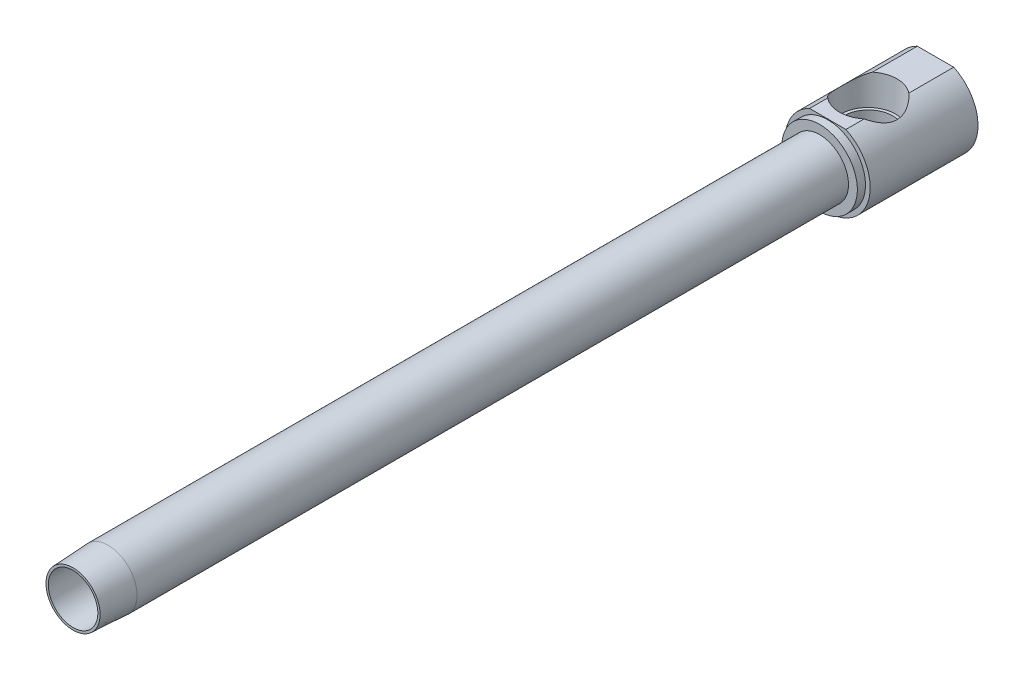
ISO-10303-21;
HEADER;
FILE_DESCRIPTION(('STEP AP214'),'2;1');
FILE_NAME('part.step','',(''),(''),'','','');
FILE_SCHEMA(('AUTOMOTIVE_DESIGN { 1 0 10303 214 1 1 1 1 }'));
ENDSEC;
DATA;
#1=APPLICATION_CONTEXT('core data for automotive mechanical design processes');
#2=APPLICATION_PROTOCOL_DEFINITION('international standard','automotive_design',2000,#1);
#3=PRODUCT_CONTEXT('',#1,'mechanical');
#4=PRODUCT('Part','Part','',(#3));
#5=PRODUCT_RELATED_PRODUCT_CATEGORY('part','',(#4));
#6=PRODUCT_DEFINITION_FORMATION('','',#4);
#7=PRODUCT_DEFINITION_CONTEXT('part definition',#1,'design');
#8=PRODUCT_DEFINITION('design','',#6,#7);
#9=PRODUCT_DEFINITION_SHAPE('','',#8);
#10=(LENGTH_UNIT() NAMED_UNIT(*) SI_UNIT(.MILLI.,.METRE.));
#11=(NAMED_UNIT(*) PLANE_ANGLE_UNIT() SI_UNIT($,.RADIAN.));
#12=(NAMED_UNIT(*) SI_UNIT($,.STERADIAN.) SOLID_ANGLE_UNIT());
#13=UNCERTAINTY_MEASURE_WITH_UNIT(LENGTH_MEASURE(1.E-05),#10,'distance_accuracy_value','');
#14=(GEOMETRIC_REPRESENTATION_CONTEXT(3) GLOBAL_UNCERTAINTY_ASSIGNED_CONTEXT((#13)) GLOBAL_UNIT_ASSIGNED_CONTEXT((#10,
#11,#12)) REPRESENTATION_CONTEXT('',''));
#15=CARTESIAN_POINT('',(0.,0.,0.));
#16=DIRECTION('',(0.,0.,1.));
#17=DIRECTION('',(1.,0.,0.));
#18=AXIS2_PLACEMENT_3D('',#15,#16,#17);
#19=CARTESIAN_POINT('',(-7.29488,0.,0.));
#20=DIRECTION('',(0.,0.,1.));
#21=DIRECTION('',(1.,0.,0.));
#22=AXIS2_PLACEMENT_3D('',#19,#20,#21);
#23=PLANE('',#22);
#24=CARTESIAN_POINT('',(0.,0.,0.));
#25=DIRECTION('',(0.,0.,-1.));
#26=DIRECTION('',(-1.,0.,0.));
#27=AXIS2_PLACEMENT_3D('',#24,#25,#26);
#28=CIRCLE('',#27,7.29488);
#29=CARTESIAN_POINT('',(-7.29488,0.,0.));
#30=VERTEX_POINT('',#29);
#31=EDGE_CURVE('E18',#30,#30,#28,.T.);
#32=ORIENTED_EDGE('',*,*,#31,.T.);
#33=EDGE_LOOP('',(#32));
#34=FACE_BOUND('',#33,.T.);
#35=CARTESIAN_POINT('',(0.,0.,0.));
#36=DIRECTION('',(0.,0.,-1.));
#37=DIRECTION('',(-1.,0.,0.));
#38=AXIS2_PLACEMENT_3D('',#35,#36,#37);
#39=CIRCLE('',#38,7.96721885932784);
#40=CARTESIAN_POINT('',(-7.96721885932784,0.,0.));
#41=VERTEX_POINT('',#40);
#42=EDGE_CURVE('E318',#41,#41,#39,.T.);
#43=ORIENTED_EDGE('',*,*,#42,.F.);
#44=EDGE_LOOP('',(#43));
#45=FACE_BOUND('',#44,.T.);
#46=ADVANCED_FACE('F15',(#34,#45),#23,.T.);
#47=CARTESIAN_POINT('',(0.,0.,-284.747166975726));
#48=DIRECTION('',(0.,0.,-1.));
#49=DIRECTION('',(-1.,0.,0.));
#50=AXIS2_PLACEMENT_3D('',#47,#48,#49);
#51=CYLINDRICAL_SURFACE('',#50,8.509);
#52=CARTESIAN_POINT('',(0.,0.,-10.3378));
#53=DIRECTION('',(0.,0.,-1.));
#54=DIRECTION('',(-1.,0.,0.));
#55=AXIS2_PLACEMENT_3D('',#52,#53,#54);
#56=CIRCLE('',#55,8.509);
#57=CARTESIAN_POINT('',(-8.509,0.,-10.3378));
#58=VERTEX_POINT('',#57);
#59=EDGE_CURVE('E320',#58,#58,#56,.T.);
#60=ORIENTED_EDGE('',*,*,#59,.T.);
#61=EDGE_LOOP('',(#60));
#62=FACE_BOUND('',#61,.T.);
#63=CARTESIAN_POINT('',(0.,0.,-219.8624));
#64=DIRECTION('',(0.,0.,-1.));
#65=DIRECTION('',(-1.,0.,0.));
#66=AXIS2_PLACEMENT_3D('',#63,#64,#65);
#67=CIRCLE('',#66,8.509);
#68=CARTESIAN_POINT('',(-8.509,0.,-219.8624));
#69=VERTEX_POINT('',#68);
#70=EDGE_CURVE('E152',#69,#69,#67,.T.);
#71=ORIENTED_EDGE('',*,*,#70,.F.);
#72=EDGE_LOOP('',(#71));
#73=FACE_BOUND('',#72,.T.);
#74=ADVANCED_FACE('F226',(#62,#73),#51,.T.);
#75=CARTESIAN_POINT('',(-5.3594,11.3032925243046,-209.55));
#76=DIRECTION('',(0.,-1.,0.));
#77=DIRECTION('',(0.,0.,-1.));
#78=AXIS2_PLACEMENT_3D('',#75,#76,#77);
#79=PLANE('',#78);
#80=DIRECTION('',(0.,0.,-1.));
#81=VECTOR('',#80,1.);
#82=CARTESIAN_POINT('',(5.3594,11.3032925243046,-209.55));
#83=LINE('',#82,#81);
#84=CARTESIAN_POINT('',(5.3594,11.3032925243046,-222.25));
#85=VERTEX_POINT('',#84);
#86=CARTESIAN_POINT('',(5.3594,11.3032925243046,-227.60323946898));
#87=VERTEX_POINT('',#86);
#88=EDGE_CURVE('E136',#85,#87,#83,.T.);
#89=ORIENTED_EDGE('',*,*,#88,.T.);
#90=CARTESIAN_POINT('',(0.,11.3032925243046,-234.188));
#91=DIRECTION('',(0.,-1.,0.));
#92=DIRECTION('',(0.,0.,-1.));
#93=AXIS2_PLACEMENT_3D('',#90,#91,#92);
#94=CIRCLE('',#93,8.49012600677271);
#95=CARTESIAN_POINT('',(-5.3594,11.3032925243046,-227.60323946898));
#96=VERTEX_POINT('',#95);
#97=EDGE_CURVE('E122',#87,#96,#94,.T.);
#98=ORIENTED_EDGE('',*,*,#97,.T.);
#99=DIRECTION('',(0.,0.,-1.));
#100=VECTOR('',#99,1.);
#101=CARTESIAN_POINT('',(-5.3594,11.3032925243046,-209.55));
#102=LINE('',#101,#100);
#103=CARTESIAN_POINT('',(-5.3594,11.3032925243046,-222.25));
#104=VERTEX_POINT('',#103);
#105=EDGE_CURVE('E147',#104,#96,#102,.T.);
#106=ORIENTED_EDGE('',*,*,#105,.F.);
#107=DIRECTION('',(1.,0.,0.));
#108=VECTOR('',#107,1.);
#109=CARTESIAN_POINT('',(-11.1125,11.3032925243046,-222.25));
#110=LINE('',#109,#108);
#111=EDGE_CURVE('E144',#104,#85,#110,.T.);
#112=ORIENTED_EDGE('',*,*,#111,.T.);
#113=EDGE_LOOP('',(#89,#98,#106,#112));
#114=FACE_BOUND('',#113,.T.);
#115=ADVANCED_FACE('F142',(#114),#79,.F.);
#116=CARTESIAN_POINT('',(0.,0.,-284.747166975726));
#117=DIRECTION('',(0.,0.,-1.));
#118=DIRECTION('',(-1.,0.,0.));
#119=AXIS2_PLACEMENT_3D('',#116,#117,#118);
#120=CYLINDRICAL_SURFACE('',#119,7.29488);
#121=ORIENTED_EDGE('',*,*,#31,.F.);
#122=EDGE_LOOP('',(#121));
#123=FACE_BOUND('',#122,.T.);
#124=CARTESIAN_POINT('',(0.,0.,-219.71));
#125=DIRECTION('',(0.,0.,-1.));
#126=DIRECTION('',(-1.,0.,0.));
#127=AXIS2_PLACEMENT_3D('',#124,#125,#126);
#128=CIRCLE('',#127,7.29488);
#129=CARTESIAN_POINT('',(-2.83926860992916,-6.71965981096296,-219.71));
#130=VERTEX_POINT('',#129);
#131=CARTESIAN_POINT('',(2.83926860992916,-6.71965981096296,-219.71));
#132=VERTEX_POINT('',#131);
#133=EDGE_CURVE('E166',#130,#132,#128,.T.);
#134=ORIENTED_EDGE('',*,*,#133,.T.);
#135=CARTESIAN_POINT('',(2.83926860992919,-6.71965981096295,-219.71));
#136=CARTESIAN_POINT('',(2.70908587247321,-6.7747056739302,-219.652021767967));
#137=CARTESIAN_POINT('',(2.57545350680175,-6.82667201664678,-219.598915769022));
#138=CARTESIAN_POINT('',(2.30236644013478,-6.92352687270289,-219.502164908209));
#139=CARTESIAN_POINT('',(2.16291320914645,-6.96841715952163,-219.458517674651));
#140=CARTESIAN_POINT('',(1.879420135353,-7.05016472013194,-219.380434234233));
#141=CARTESIAN_POINT('',(1.73538792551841,-7.08703463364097,-219.345983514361));
#142=CARTESIAN_POINT('',(1.44358277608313,-7.15218030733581,-219.285918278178));
#143=CARTESIAN_POINT('',(1.29580969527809,-7.18045574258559,-219.26030409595));
#144=CARTESIAN_POINT('',(0.997667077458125,-7.22791200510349,-219.217692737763));
#145=CARTESIAN_POINT('',(0.847298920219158,-7.2470975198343,-219.200691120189));
#146=CARTESIAN_POINT('',(0.544945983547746,-7.27608226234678,-219.175120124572));
#147=CARTESIAN_POINT('',(0.392961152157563,-7.28588118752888,-219.16655101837));
#148=CARTESIAN_POINT('',(0.0883390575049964,-7.29593786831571,-219.157757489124));
#149=CARTESIAN_POINT('',(-0.0642985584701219,-7.29618956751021,-219.157538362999));
#150=CARTESIAN_POINT('',(-0.369068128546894,-7.28713276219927,-219.165455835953));
#151=CARTESIAN_POINT('',(-0.521200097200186,-7.27782453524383,-219.173592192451));
#152=CARTESIAN_POINT('',(-0.825795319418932,-7.24962203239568,-219.198456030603));
#153=CARTESIAN_POINT('',(-0.978239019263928,-7.23060958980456,-219.215289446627));
#154=CARTESIAN_POINT('',(-1.28042184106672,-7.18325692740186,-219.257772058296));
#155=CARTESIAN_POINT('',(-1.43016107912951,-7.15491710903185,-219.283420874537));
#156=CARTESIAN_POINT('',(-1.72558403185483,-7.08946317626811,-219.343720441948));
#157=CARTESIAN_POINT('',(-1.87127414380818,-7.05236389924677,-219.378355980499));
#158=CARTESIAN_POINT('',(-2.15770494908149,-6.97006186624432,-219.456925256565));
#159=CARTESIAN_POINT('',(-2.29844851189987,-6.92486390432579,-219.500853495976));
#160=CARTESIAN_POINT('',(-2.50498218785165,-6.85169148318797,-219.573911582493));
#161=CARTESIAN_POINT('',(-2.5730332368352,-6.82641747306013,-219.599445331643));
#162=CARTESIAN_POINT('',(-2.70743134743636,-6.77423657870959,-219.652910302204));
#163=CARTESIAN_POINT('',(-2.77378053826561,-6.74733189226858,-219.680838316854));
#164=CARTESIAN_POINT('',(-2.83926860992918,-6.7196598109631,-219.71));
#165=B_SPLINE_CURVE_WITH_KNOTS('',3,(#135,#136,#137,#138,#139,#140,#141,#142,#143,#144,#145,
#146,#147,#148,#149,#150,#151,#152,#153,#154,#155,#156,#157,#158,#159,#160,#161,#162,#163,#164),
.UNSPECIFIED.,.F.,.F.,(4,2,2,2,2,2,2,2,2,2,2,2,2,2,4),(0.,0.458141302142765,0.91616759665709,
1.37346674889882,1.8307831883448,2.28786354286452,2.74495863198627,3.202343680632,
3.65971545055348,4.12279436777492,4.58585335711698,5.04813354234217,5.51014097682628,
5.74093493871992,5.97142447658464),.UNSPECIFIED.);
#166=EDGE_CURVE('E228',#132,#130,#165,.T.);
#167=ORIENTED_EDGE('',*,*,#166,.T.);
#168=EDGE_LOOP('',(#134,#167));
#169=FACE_BOUND('',#168,.T.);
#170=ADVANCED_FACE('F221',(#123,#169),#120,.F.);
#171=CARTESIAN_POINT('',(-7.29488,0.,-219.71));
#172=DIRECTION('',(0.,0.,1.));
#173=DIRECTION('',(1.,0.,0.));
#174=AXIS2_PLACEMENT_3D('',#171,#172,#173);
#175=PLANE('',#174);
#176=ORIENTED_EDGE('',*,*,#133,.F.);
#177=CARTESIAN_POINT('',(0.,-0.996470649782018,-219.71));
#178=DIRECTION('',(0.,0.,1.));
#179=DIRECTION('',(0.,-1.,0.));
#180=AXIS2_PLACEMENT_3D('',#177,#178,#179);
#181=ELLIPSE('',#180,6.41876281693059,6.27107494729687);
#182=EDGE_CURVE('E170',#130,#132,#181,.F.);
#183=ORIENTED_EDGE('',*,*,#182,.T.);
#184=EDGE_LOOP('',(#176,#183));
#185=FACE_BOUND('',#184,.T.);
#186=ADVANCED_FACE('F217',(#185),#175,.T.);
#187=CARTESIAN_POINT('',(-12.5095,0.,-254.));
#188=DIRECTION('',(0.,0.,-1.));
#189=DIRECTION('',(-1.,0.,0.));
#190=AXIS2_PLACEMENT_3D('',#187,#188,#189);
#191=PLANE('',#190);
#192=DIRECTION('',(1.,0.,0.));
#193=VECTOR('',#192,1.);
#194=CARTESIAN_POINT('',(-3.66617420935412,6.35,-254.));
#195=LINE('',#194,#193);
#196=CARTESIAN_POINT('',(-3.66617420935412,6.35,-254.));
#197=VERTEX_POINT('',#196);
#198=CARTESIAN_POINT('',(3.66617420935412,6.35,-254.));
#199=VERTEX_POINT('',#198);
#200=EDGE_CURVE('E235',#197,#199,#195,.T.);
#201=ORIENTED_EDGE('',*,*,#200,.F.);
#202=DIRECTION('',(0.5,0.866025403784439,0.));
#203=VECTOR('',#202,1.);
#204=CARTESIAN_POINT('',(-7.33234841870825,0.,-254.));
#205=LINE('',#204,#203);
#206=CARTESIAN_POINT('',(-7.33234841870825,0.,-254.));
#207=VERTEX_POINT('',#206);
#208=EDGE_CURVE('E242',#207,#197,#205,.T.);
#209=ORIENTED_EDGE('',*,*,#208,.F.);
#210=DIRECTION('',(-0.5,0.866025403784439,0.));
#211=VECTOR('',#210,1.);
#212=CARTESIAN_POINT('',(-3.66617420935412,-6.35,-254.));
#213=LINE('',#212,#211);
#214=CARTESIAN_POINT('',(-3.66617420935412,-6.35,-254.));
#215=VERTEX_POINT('',#214);
#216=EDGE_CURVE('E268',#215,#207,#213,.T.);
#217=ORIENTED_EDGE('',*,*,#216,.F.);
#218=DIRECTION('',(-1.,0.,0.));
#219=VECTOR('',#218,1.);
#220=CARTESIAN_POINT('',(3.66617420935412,-6.35,-254.));
#221=LINE('',#220,#219);
#222=CARTESIAN_POINT('',(3.66617420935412,-6.35,-254.));
#223=VERTEX_POINT('',#222);
#224=EDGE_CURVE('E265',#223,#215,#221,.T.);
#225=ORIENTED_EDGE('',*,*,#224,.F.);
#226=DIRECTION('',(-0.5,-0.866025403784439,0.));
#227=VECTOR('',#226,1.);
#228=CARTESIAN_POINT('',(7.33234841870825,0.,-254.));
#229=LINE('',#228,#227);
#230=CARTESIAN_POINT('',(7.33234841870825,0.,-254.));
#231=VERTEX_POINT('',#230);
#232=EDGE_CURVE('E262',#231,#223,#229,.T.);
#233=ORIENTED_EDGE('',*,*,#232,.F.);
#234=DIRECTION('',(0.5,-0.866025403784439,0.));
#235=VECTOR('',#234,1.);
#236=CARTESIAN_POINT('',(3.66617420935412,6.35,-254.));
#237=LINE('',#236,#235);
#238=EDGE_CURVE('E259',#199,#231,#237,.T.);
#239=ORIENTED_EDGE('',*,*,#238,.F.);
#240=EDGE_LOOP('',(#201,#209,#217,#225,#233,#239));
#241=FACE_BOUND('',#240,.T.);
#242=DIRECTION('',(-1.,0.,0.));
#243=VECTOR('',#242,1.);
#244=CARTESIAN_POINT('',(-5.3594,11.3032925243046,-254.));
#245=LINE('',#244,#243);
#246=CARTESIAN_POINT('',(5.3594,11.3032925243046,-254.));
#247=VERTEX_POINT('',#246);
#248=CARTESIAN_POINT('',(-5.3594,11.3032925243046,-254.));
#249=VERTEX_POINT('',#248);
#250=EDGE_CURVE('E149',#247,#249,#245,.T.);
#251=ORIENTED_EDGE('',*,*,#250,.F.);
#252=CARTESIAN_POINT('',(0.,0.,-254.));
#253=DIRECTION('',(0.,0.,-1.));
#254=DIRECTION('',(-1.,0.,0.));
#255=AXIS2_PLACEMENT_3D('',#252,#253,#254);
#256=CIRCLE('',#255,12.5095);
#257=EDGE_CURVE('E163',#247,#249,#256,.T.);
#258=ORIENTED_EDGE('',*,*,#257,.T.);
#259=EDGE_LOOP('',(#251,#258));
#260=FACE_BOUND('',#259,.T.);
#261=ADVANCED_FACE('F212',(#241,#260),#191,.T.);
#262=CARTESIAN_POINT('',(0.,0.,-284.747166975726));
#263=DIRECTION('',(0.,0.,-1.));
#264=DIRECTION('',(-1.,0.,0.));
#265=AXIS2_PLACEMENT_3D('',#262,#263,#264);
#266=CYLINDRICAL_SURFACE('',#265,12.5095);
#267=CARTESIAN_POINT('',(5.3589781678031,11.3034925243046,-227.602882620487));
#268=CARTESIAN_POINT('',(5.54921369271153,11.2133234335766,-227.763840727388));
#269=CARTESIAN_POINT('',(5.73165431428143,11.1209258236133,-227.932665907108));
#270=CARTESIAN_POINT('',(6.08048620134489,10.9340894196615,-228.285220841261));
#271=CARTESIAN_POINT('',(6.24687354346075,10.8396501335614,-228.46895421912));
#272=CARTESIAN_POINT('',(6.56420314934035,10.650502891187,-228.851812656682));
#273=CARTESIAN_POINT('',(6.71502345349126,10.5557980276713,-229.051040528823));
#274=CARTESIAN_POINT('',(6.99914257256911,10.3695935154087,-229.462863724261));
#275=CARTESIAN_POINT('',(7.13244448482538,10.2780933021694,-229.675456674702));
#276=CARTESIAN_POINT('',(7.46650834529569,10.0401700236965,-230.264674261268));
#277=CARTESIAN_POINT('',(7.6505480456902,9.89929381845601,-230.653481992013));
#278=CARTESIAN_POINT('',(7.88323238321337,9.71350267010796,-231.259963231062));
#279=CARTESIAN_POINT('',(7.95350713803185,9.65587918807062,-231.465745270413));
#280=CARTESIAN_POINT('',(8.07900681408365,9.5511210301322,-231.884515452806));
#281=CARTESIAN_POINT('',(8.1342346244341,9.50398434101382,-232.097502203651));
#282=CARTESIAN_POINT('',(8.22106638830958,9.42891275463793,-232.494107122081));
#283=CARTESIAN_POINT('',(8.25505388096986,9.39910020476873,-232.676852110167));
#284=CARTESIAN_POINT('',(8.3114428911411,9.34927427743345,-233.045430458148));
#285=CARTESIAN_POINT('',(8.3338466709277,9.32925898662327,-233.231263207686));
#286=CARTESIAN_POINT('',(8.36672861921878,9.29978140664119,-233.604727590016));
#287=CARTESIAN_POINT('',(8.37721265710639,9.29031392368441,-233.79235829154));
#288=CARTESIAN_POINT('',(8.3861052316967,9.28228778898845,-234.168146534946));
#289=CARTESIAN_POINT('',(8.38451351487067,9.28372936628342,-234.356304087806));
#290=CARTESIAN_POINT('',(8.36928475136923,9.29746017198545,-234.731613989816));
#291=CARTESIAN_POINT('',(8.35565497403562,9.30974285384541,-234.91876687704));
#292=CARTESIAN_POINT('',(8.3165791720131,9.3446659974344,-235.290843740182));
#293=CARTESIAN_POINT('',(8.2911332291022,9.36730638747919,-235.475767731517));
#294=CARTESIAN_POINT('',(8.22876601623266,9.42213985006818,-235.842394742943));
#295=CARTESIAN_POINT('',(8.19183425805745,9.45434165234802,-236.024094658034));
#296=CARTESIAN_POINT('',(8.10694730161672,9.52723048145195,-236.383247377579));
#297=CARTESIAN_POINT('',(8.0589858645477,9.56792230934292,-236.56069771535));
#298=CARTESIAN_POINT('',(7.93720028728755,9.66935365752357,-236.960957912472));
#299=CARTESIAN_POINT('',(7.85990590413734,9.73249157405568,-237.182109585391));
#300=CARTESIAN_POINT('',(7.68886075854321,9.86817719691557,-237.614976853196));
#301=CARTESIAN_POINT('',(7.5951043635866,9.94072812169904,-237.826689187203));
#302=CARTESIAN_POINT('',(7.39186656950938,10.092770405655,-238.240230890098));
#303=CARTESIAN_POINT('',(7.28236248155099,10.172271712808,-238.442045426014));
#304=CARTESIAN_POINT('',(7.04849385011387,10.3357003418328,-238.834850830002));
#305=CARTESIAN_POINT('',(6.92413202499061,10.4196268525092,-239.0258436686));
#306=CARTESIAN_POINT('',(6.58695562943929,10.6376413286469,-239.501021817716));
#307=CARTESIAN_POINT('',(6.36373226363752,10.7733928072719,-239.777203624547));
#308=CARTESIAN_POINT('',(6.00459360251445,10.9750283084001,-240.168460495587));
#309=CARTESIAN_POINT('',(5.88113847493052,11.0417585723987,-240.294781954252));
#310=CARTESIAN_POINT('',(5.62611191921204,11.1738564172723,-240.539769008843));
#311=CARTESIAN_POINT('',(5.49453878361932,11.2392237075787,-240.658432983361));
#312=CARTESIAN_POINT('',(5.3589781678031,11.3034925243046,-240.773117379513));
#313=B_SPLINE_CURVE_WITH_KNOTS('',3,(#267,#268,#269,#270,#271,#272,#273,#274,#275,#276,#277,
#278,#279,#280,#281,#282,#283,#284,#285,#286,#287,#288,#289,#290,#291,#292,#293,#294,#295,#296,
#297,#298,#299,#300,#301,#302,#303,#304,#305,#306,#307,#308,#309,#310,#311,#312),.UNSPECIFIED.,
.F.,.F.,(4,2,2,2,2,2,2,2,2,2,2,2,2,2,2,2,2,2,2,2,2,2,4),(0.,0.794684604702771,1.58956293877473,
2.39025916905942,3.19081364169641,4.54240556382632,5.21661127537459,5.89068744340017,
6.45486541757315,7.01893316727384,7.58272304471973,8.14652475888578,8.70998624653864,
9.27344383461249,9.83741745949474,10.4017108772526,11.1285534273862,11.855645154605,
12.5837951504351,13.3118121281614,14.4492964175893,15.0154674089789,15.5817578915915),.UNSPECIFIED.);
#314=CARTESIAN_POINT('',(5.3594,11.3032925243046,-240.77276053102));
#315=VERTEX_POINT('',#314);
#316=EDGE_CURVE('E30',#87,#315,#313,.T.);
#317=ORIENTED_EDGE('',*,*,#316,.F.);
#318=ORIENTED_EDGE('',*,*,#88,.F.);
#319=CARTESIAN_POINT('',(0.,0.,-222.25));
#320=DIRECTION('',(0.,0.,-1.));
#321=DIRECTION('',(-1.,0.,0.));
#322=AXIS2_PLACEMENT_3D('',#319,#320,#321);
#323=CIRCLE('',#322,12.5095);
#324=EDGE_CURVE('E161',#85,#104,#323,.T.);
#325=ORIENTED_EDGE('',*,*,#324,.T.);
#326=ORIENTED_EDGE('',*,*,#105,.T.);
#327=CARTESIAN_POINT('',(-5.3589781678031,11.3034925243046,-240.773117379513));
#328=CARTESIAN_POINT('',(-5.54921369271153,11.2133234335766,-240.612159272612));
#329=CARTESIAN_POINT('',(-5.73165431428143,11.1209258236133,-240.443334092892));
#330=CARTESIAN_POINT('',(-6.0804862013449,10.9340894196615,-240.090779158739));
#331=CARTESIAN_POINT('',(-6.24687354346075,10.8396501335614,-239.90704578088));
#332=CARTESIAN_POINT('',(-6.56420314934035,10.650502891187,-239.524187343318));
#333=CARTESIAN_POINT('',(-6.71502345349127,10.5557980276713,-239.324959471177));
#334=CARTESIAN_POINT('',(-6.99914257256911,10.3695935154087,-238.913136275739));
#335=CARTESIAN_POINT('',(-7.13244448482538,10.2780933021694,-238.700543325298));
#336=CARTESIAN_POINT('',(-7.46650834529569,10.0401700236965,-238.111325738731));
#337=CARTESIAN_POINT('',(-7.65054804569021,9.899293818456,-237.722518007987));
#338=CARTESIAN_POINT('',(-7.88323238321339,9.71350267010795,-237.116036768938));
#339=CARTESIAN_POINT('',(-7.95350713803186,9.65587918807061,-236.910254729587));
#340=CARTESIAN_POINT('',(-8.07900681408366,9.5511210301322,-236.491484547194));
#341=CARTESIAN_POINT('',(-8.1342346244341,9.50398434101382,-236.278497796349));
#342=CARTESIAN_POINT('',(-8.22106638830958,9.42891275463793,-235.881892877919));
#343=CARTESIAN_POINT('',(-8.25505388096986,9.39910020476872,-235.699147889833));
#344=CARTESIAN_POINT('',(-8.3114428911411,9.34927427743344,-235.330569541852));
#345=CARTESIAN_POINT('',(-8.33384667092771,9.32925898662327,-235.144736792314));
#346=CARTESIAN_POINT('',(-8.36672861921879,9.29978140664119,-234.771272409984));
#347=CARTESIAN_POINT('',(-8.37721265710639,9.29031392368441,-234.58364170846));
#348=CARTESIAN_POINT('',(-8.3861052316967,9.28228778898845,-234.207853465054));
#349=CARTESIAN_POINT('',(-8.38451351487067,9.28372936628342,-234.019695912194));
#350=CARTESIAN_POINT('',(-8.36928475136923,9.29746017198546,-233.644386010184));
#351=CARTESIAN_POINT('',(-8.35565497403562,9.30974285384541,-233.45723312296));
#352=CARTESIAN_POINT('',(-8.31657917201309,9.34466599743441,-233.085156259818));
#353=CARTESIAN_POINT('',(-8.29113322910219,9.36730638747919,-232.900232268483));
#354=CARTESIAN_POINT('',(-8.22876601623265,9.42213985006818,-232.533605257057));
#355=CARTESIAN_POINT('',(-8.19183425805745,9.45434165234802,-232.351905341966));
#356=CARTESIAN_POINT('',(-8.10694730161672,9.52723048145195,-231.992752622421));
#357=CARTESIAN_POINT('',(-8.0589858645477,9.56792230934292,-231.81530228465));
#358=CARTESIAN_POINT('',(-7.93720028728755,9.66935365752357,-231.415042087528));
#359=CARTESIAN_POINT('',(-7.85990590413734,9.73249157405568,-231.193890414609));
#360=CARTESIAN_POINT('',(-7.68886075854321,9.86817719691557,-230.761023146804));
#361=CARTESIAN_POINT('',(-7.59510436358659,9.94072812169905,-230.549310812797));
#362=CARTESIAN_POINT('',(-7.39186656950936,10.092770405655,-230.135769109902));
#363=CARTESIAN_POINT('',(-7.28236248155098,10.172271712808,-229.933954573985));
#364=CARTESIAN_POINT('',(-7.04849385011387,10.3357003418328,-229.541149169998));
#365=CARTESIAN_POINT('',(-6.92413202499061,10.4196268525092,-229.3501563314));
#366=CARTESIAN_POINT('',(-6.5869556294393,10.6376413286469,-228.874978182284));
#367=CARTESIAN_POINT('',(-6.36373226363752,10.7733928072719,-228.598796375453));
#368=CARTESIAN_POINT('',(-6.00459360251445,10.9750283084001,-228.207539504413));
#369=CARTESIAN_POINT('',(-5.88113847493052,11.0417585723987,-228.081218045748));
#370=CARTESIAN_POINT('',(-5.62611191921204,11.1738564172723,-227.836230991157));
#371=CARTESIAN_POINT('',(-5.49453878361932,11.2392237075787,-227.717567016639));
#372=CARTESIAN_POINT('',(-5.3589781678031,11.3034925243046,-227.602882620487));
#373=B_SPLINE_CURVE_WITH_KNOTS('',3,(#327,#328,#329,#330,#331,#332,#333,#334,#335,#336,#337,
#338,#339,#340,#341,#342,#343,#344,#345,#346,#347,#348,#349,#350,#351,#352,#353,#354,#355,#356,
#357,#358,#359,#360,#361,#362,#363,#364,#365,#366,#367,#368,#369,#370,#371,#372),.UNSPECIFIED.,
.F.,.F.,(4,2,2,2,2,2,2,2,2,2,2,2,2,2,2,2,2,2,2,2,2,2,4),(0.,0.794684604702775,1.58956293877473,
2.39025916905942,3.19081364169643,4.54240556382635,5.21661127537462,5.8906874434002,
6.45486541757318,7.01893316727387,7.58272304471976,8.14652475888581,8.70998624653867,
9.27344383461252,9.83741745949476,10.4017108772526,11.1285534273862,11.8556451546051,
12.5837951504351,13.3118121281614,14.4492964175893,15.0154674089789,15.5817578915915),.UNSPECIFIED.);
#374=CARTESIAN_POINT('',(-5.3594,11.3032925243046,-240.77276053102));
#375=VERTEX_POINT('',#374);
#376=EDGE_CURVE('E125',#375,#96,#373,.T.);
#377=ORIENTED_EDGE('',*,*,#376,.F.);
#378=EDGE_CURVE('E145',#375,#249,#102,.T.);
#379=ORIENTED_EDGE('',*,*,#378,.T.);
#380=ORIENTED_EDGE('',*,*,#257,.F.);
#381=EDGE_CURVE('E139',#315,#247,#83,.T.);
#382=ORIENTED_EDGE('',*,*,#381,.F.);
#383=EDGE_LOOP('',(#317,#318,#325,#326,#377,#379,#380,#382));
#384=FACE_BOUND('',#383,.T.);
#385=ADVANCED_FACE('F134',(#384),#266,.T.);
#386=CARTESIAN_POINT('',(-11.1125,0.,-222.25));
#387=DIRECTION('',(0.,0.,1.));
#388=DIRECTION('',(1.,0.,0.));
#389=AXIS2_PLACEMENT_3D('',#386,#387,#388);
#390=PLANE('',#389);
#391=ORIENTED_EDGE('',*,*,#111,.F.);
#392=ORIENTED_EDGE('',*,*,#324,.F.);
#393=EDGE_LOOP('',(#391,#392));
#394=FACE_BOUND('',#393,.T.);
#395=CARTESIAN_POINT('',(0.,0.,-222.25));
#396=DIRECTION('',(0.,0.,-1.));
#397=DIRECTION('',(-1.,0.,0.));
#398=AXIS2_PLACEMENT_3D('',#395,#396,#397);
#399=CIRCLE('',#398,11.1125);
#400=CARTESIAN_POINT('',(-11.1125,0.,-222.25));
#401=VERTEX_POINT('',#400);
#402=EDGE_CURVE('E158',#401,#401,#399,.T.);
#403=ORIENTED_EDGE('',*,*,#402,.T.);
#404=EDGE_LOOP('',(#403));
#405=FACE_BOUND('',#404,.T.);
#406=ADVANCED_FACE('F211',(#394,#405),#390,.T.);
#407=CARTESIAN_POINT('',(0.,0.,-284.747166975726));
#408=DIRECTION('',(0.,0.,-1.));
#409=DIRECTION('',(-1.,0.,0.));
#410=AXIS2_PLACEMENT_3D('',#407,#408,#409);
#411=CYLINDRICAL_SURFACE('',#410,11.1125);
#412=CARTESIAN_POINT('',(0.,0.,-219.8624));
#413=DIRECTION('',(0.,0.,-1.));
#414=DIRECTION('',(-1.,0.,0.));
#415=AXIS2_PLACEMENT_3D('',#412,#413,#414);
#416=CIRCLE('',#415,11.1125);
#417=CARTESIAN_POINT('',(-11.1125,0.,-219.8624));
#418=VERTEX_POINT('',#417);
#419=EDGE_CURVE('E155',#418,#418,#416,.T.);
#420=ORIENTED_EDGE('',*,*,#419,.T.);
#421=EDGE_LOOP('',(#420));
#422=FACE_BOUND('',#421,.T.);
#423=ORIENTED_EDGE('',*,*,#402,.F.);
#424=EDGE_LOOP('',(#423));
#425=FACE_BOUND('',#424,.T.);
#426=ADVANCED_FACE('F293',(#422,#425),#411,.T.);
#427=CARTESIAN_POINT('',(-8.509,0.,-219.8624));
#428=DIRECTION('',(0.,0.,1.));
#429=DIRECTION('',(1.,0.,0.));
#430=AXIS2_PLACEMENT_3D('',#427,#428,#429);
#431=PLANE('',#430);
#432=ORIENTED_EDGE('',*,*,#70,.T.);
#433=EDGE_LOOP('',(#432));
#434=FACE_BOUND('',#433,.T.);
#435=ORIENTED_EDGE('',*,*,#419,.F.);
#436=EDGE_LOOP('',(#435));
#437=FACE_BOUND('',#436,.T.);
#438=ADVANCED_FACE('F297',(#434,#437),#431,.T.);
#439=ORIENTED_EDGE('',*,*,#378,.F.);
#440=EDGE_CURVE('E129',#375,#315,#94,.T.);
#441=ORIENTED_EDGE('',*,*,#440,.T.);
#442=ORIENTED_EDGE('',*,*,#381,.T.);
#443=ORIENTED_EDGE('',*,*,#250,.T.);
#444=EDGE_LOOP('',(#439,#441,#442,#443));
#445=FACE_BOUND('',#444,.T.);
#446=ADVANCED_FACE('F288',(#445),#79,.F.);
#447=CARTESIAN_POINT('',(-3.66617420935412,6.35,-247.65));
#448=DIRECTION('',(0.,1.,0.));
#449=DIRECTION('',(-1.,0.,0.));
#450=AXIS2_PLACEMENT_3D('',#447,#448,#449);
#451=PLANE('',#450);
#452=ORIENTED_EDGE('',*,*,#200,.T.);
#453=DIRECTION('',(0.,0.,-1.));
#454=VECTOR('',#453,1.);
#455=CARTESIAN_POINT('',(3.66617420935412,6.35,-247.65));
#456=LINE('',#455,#454);
#457=CARTESIAN_POINT('',(3.66617420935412,6.35,-247.65));
#458=VERTEX_POINT('',#457);
#459=EDGE_CURVE('E257',#458,#199,#456,.T.);
#460=ORIENTED_EDGE('',*,*,#459,.F.);
#461=DIRECTION('',(1.,0.,0.));
#462=VECTOR('',#461,1.);
#463=CARTESIAN_POINT('',(-3.66617420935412,6.35,-247.65));
#464=LINE('',#463,#462);
#465=CARTESIAN_POINT('',(-3.66617420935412,6.35,-247.65));
#466=VERTEX_POINT('',#465);
#467=EDGE_CURVE('E238',#466,#458,#464,.T.);
#468=ORIENTED_EDGE('',*,*,#467,.F.);
#469=DIRECTION('',(0.,0.,-1.));
#470=VECTOR('',#469,1.);
#471=CARTESIAN_POINT('',(-3.66617420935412,6.35,-247.65));
#472=LINE('',#471,#470);
#473=EDGE_CURVE('E273',#466,#197,#472,.T.);
#474=ORIENTED_EDGE('',*,*,#473,.T.);
#475=EDGE_LOOP('',(#452,#460,#468,#474));
#476=FACE_BOUND('',#475,.T.);
#477=ADVANCED_FACE('F392',(#476),#451,.F.);
#478=CARTESIAN_POINT('',(-7.33234841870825,0.,-247.65));
#479=DIRECTION('',(-0.866025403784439,0.5,0.));
#480=DIRECTION('',(-0.5,-0.866025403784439,0.));
#481=AXIS2_PLACEMENT_3D('',#478,#479,#480);
#482=PLANE('',#481);
#483=ORIENTED_EDGE('',*,*,#208,.T.);
#484=ORIENTED_EDGE('',*,*,#473,.F.);
#485=DIRECTION('',(0.5,0.866025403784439,0.));
#486=VECTOR('',#485,1.);
#487=CARTESIAN_POINT('',(-7.33234841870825,0.,-247.65));
#488=LINE('',#487,#486);
#489=CARTESIAN_POINT('',(-7.33234841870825,0.,-247.65));
#490=VERTEX_POINT('',#489);
#491=EDGE_CURVE('E254',#490,#466,#488,.T.);
#492=ORIENTED_EDGE('',*,*,#491,.F.);
#493=DIRECTION('',(0.,0.,-1.));
#494=VECTOR('',#493,1.);
#495=CARTESIAN_POINT('',(-7.33234841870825,0.,-247.65));
#496=LINE('',#495,#494);
#497=EDGE_CURVE('E275',#490,#207,#496,.T.);
#498=ORIENTED_EDGE('',*,*,#497,.T.);
#499=EDGE_LOOP('',(#483,#484,#492,#498));
#500=FACE_BOUND('',#499,.T.);
#501=ADVANCED_FACE('F388',(#500),#482,.F.);
#502=CARTESIAN_POINT('',(-3.66617420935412,-6.35,-247.65));
#503=DIRECTION('',(-0.866025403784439,-0.5,0.));
#504=DIRECTION('',(0.5,-0.866025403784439,0.));
#505=AXIS2_PLACEMENT_3D('',#502,#503,#504);
#506=PLANE('',#505);
#507=ORIENTED_EDGE('',*,*,#216,.T.);
#508=ORIENTED_EDGE('',*,*,#497,.F.);
#509=DIRECTION('',(-0.5,0.866025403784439,0.));
#510=VECTOR('',#509,1.);
#511=CARTESIAN_POINT('',(-3.66617420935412,-6.35,-247.65));
#512=LINE('',#511,#510);
#513=CARTESIAN_POINT('',(-3.66617420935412,-6.35,-247.65));
#514=VERTEX_POINT('',#513);
#515=EDGE_CURVE('E251',#514,#490,#512,.T.);
#516=ORIENTED_EDGE('',*,*,#515,.F.);
#517=DIRECTION('',(0.,0.,-1.));
#518=VECTOR('',#517,1.);
#519=CARTESIAN_POINT('',(-3.66617420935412,-6.35,-247.65));
#520=LINE('',#519,#518);
#521=EDGE_CURVE('E277',#514,#215,#520,.T.);
#522=ORIENTED_EDGE('',*,*,#521,.T.);
#523=EDGE_LOOP('',(#507,#508,#516,#522));
#524=FACE_BOUND('',#523,.T.);
#525=ADVANCED_FACE('F391',(#524),#506,.F.);
#526=CARTESIAN_POINT('',(3.66617420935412,-6.35,-247.65));
#527=DIRECTION('',(0.,-1.,0.));
#528=DIRECTION('',(1.,0.,0.));
#529=AXIS2_PLACEMENT_3D('',#526,#527,#528);
#530=PLANE('',#529);
#531=ORIENTED_EDGE('',*,*,#224,.T.);
#532=ORIENTED_EDGE('',*,*,#521,.F.);
#533=DIRECTION('',(-1.,0.,0.));
#534=VECTOR('',#533,1.);
#535=CARTESIAN_POINT('',(3.66617420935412,-6.35,-247.65));
#536=LINE('',#535,#534);
#537=CARTESIAN_POINT('',(3.66617420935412,-6.35,-247.65));
#538=VERTEX_POINT('',#537);
#539=EDGE_CURVE('E248',#538,#514,#536,.T.);
#540=ORIENTED_EDGE('',*,*,#539,.F.);
#541=DIRECTION('',(0.,0.,-1.));
#542=VECTOR('',#541,1.);
#543=CARTESIAN_POINT('',(3.66617420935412,-6.35,-247.65));
#544=LINE('',#543,#542);
#545=EDGE_CURVE('E279',#538,#223,#544,.T.);
#546=ORIENTED_EDGE('',*,*,#545,.T.);
#547=EDGE_LOOP('',(#531,#532,#540,#546));
#548=FACE_BOUND('',#547,.T.);
#549=ADVANCED_FACE('F396',(#548),#530,.F.);
#550=CARTESIAN_POINT('',(7.33234841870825,0.,-247.65));
#551=DIRECTION('',(0.866025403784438,-0.5,0.));
#552=DIRECTION('',(0.5,0.866025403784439,0.));
#553=AXIS2_PLACEMENT_3D('',#550,#551,#552);
#554=PLANE('',#553);
#555=ORIENTED_EDGE('',*,*,#232,.T.);
#556=ORIENTED_EDGE('',*,*,#545,.F.);
#557=DIRECTION('',(-0.5,-0.866025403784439,0.));
#558=VECTOR('',#557,1.);
#559=CARTESIAN_POINT('',(7.33234841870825,0.,-247.65));
#560=LINE('',#559,#558);
#561=CARTESIAN_POINT('',(7.33234841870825,0.,-247.65));
#562=VERTEX_POINT('',#561);
#563=EDGE_CURVE('E245',#562,#538,#560,.T.);
#564=ORIENTED_EDGE('',*,*,#563,.F.);
#565=DIRECTION('',(0.,0.,-1.));
#566=VECTOR('',#565,1.);
#567=CARTESIAN_POINT('',(7.33234841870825,0.,-247.65));
#568=LINE('',#567,#566);
#569=EDGE_CURVE('E281',#562,#231,#568,.T.);
#570=ORIENTED_EDGE('',*,*,#569,.T.);
#571=EDGE_LOOP('',(#555,#556,#564,#570));
#572=FACE_BOUND('',#571,.T.);
#573=ADVANCED_FACE('F400',(#572),#554,.F.);
#574=CARTESIAN_POINT('',(3.66617420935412,6.35,-247.65));
#575=DIRECTION('',(0.866025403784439,0.5,0.));
#576=DIRECTION('',(-0.5,0.866025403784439,0.));
#577=AXIS2_PLACEMENT_3D('',#574,#575,#576);
#578=PLANE('',#577);
#579=ORIENTED_EDGE('',*,*,#238,.T.);
#580=ORIENTED_EDGE('',*,*,#569,.F.);
#581=DIRECTION('',(0.5,-0.866025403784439,0.));
#582=VECTOR('',#581,1.);
#583=CARTESIAN_POINT('',(3.66617420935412,6.35,-247.65));
#584=LINE('',#583,#582);
#585=EDGE_CURVE('E241',#458,#562,#584,.T.);
#586=ORIENTED_EDGE('',*,*,#585,.F.);
#587=ORIENTED_EDGE('',*,*,#459,.T.);
#588=EDGE_LOOP('',(#579,#580,#586,#587));
#589=FACE_BOUND('',#588,.T.);
#590=ADVANCED_FACE('F386',(#589),#578,.F.);
#591=CARTESIAN_POINT('',(0.,0.,-247.65));
#592=DIRECTION('',(0.,0.,-1.));
#593=DIRECTION('',(-1.,0.,0.));
#594=AXIS2_PLACEMENT_3D('',#591,#592,#593);
#595=PLANE('',#594);
#596=ORIENTED_EDGE('',*,*,#467,.T.);
#597=ORIENTED_EDGE('',*,*,#585,.T.);
#598=ORIENTED_EDGE('',*,*,#563,.T.);
#599=ORIENTED_EDGE('',*,*,#539,.T.);
#600=ORIENTED_EDGE('',*,*,#515,.T.);
#601=ORIENTED_EDGE('',*,*,#491,.T.);
#602=EDGE_LOOP('',(#596,#597,#598,#599,#600,#601));
#603=FACE_BOUND('',#602,.T.);
#604=ADVANCED_FACE('F381',(#603),#595,.T.);
#605=CARTESIAN_POINT('',(0.,-4.02688128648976,-233.591711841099));
#606=DIRECTION('',(0.,0.213279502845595,0.976991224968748));
#607=DIRECTION('',(0.,-0.976991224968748,0.213279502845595));
#608=AXIS2_PLACEMENT_3D('',#605,#606,#607);
#609=CONICAL_SURFACE('',#608,6.27107494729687,0.738529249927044);
#610=CARTESIAN_POINT('',(0.,-7.8171617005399,-236.301165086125));
#611=CARTESIAN_POINT('',(0.030648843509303,-7.81716198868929,-236.301165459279));
#612=CARTESIAN_POINT('',(0.0612977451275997,-7.81694149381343,-236.300879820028));
#613=CARTESIAN_POINT('',(0.129766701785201,-7.81595747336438,-236.299605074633));
#614=CARTESIAN_POINT('',(0.167582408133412,-7.81507869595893,-236.298466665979));
#615=CARTESIAN_POINT('',(0.243722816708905,-7.81263621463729,-236.295302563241));
#616=CARTESIAN_POINT('',(0.282046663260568,-7.81106245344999,-236.293263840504));
#617=CARTESIAN_POINT('',(0.338345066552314,-7.80824831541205,-236.289618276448));
#618=CARTESIAN_POINT('',(0.356356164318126,-7.80727222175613,-236.288353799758));
#619=CARTESIAN_POINT('',(0.446379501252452,-7.8020163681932,-236.281545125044));
#620=CARTESIAN_POINT('',(0.518221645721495,-7.79661392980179,-236.274546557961));
#621=CARTESIAN_POINT('',(0.733733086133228,-7.77685263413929,-236.248946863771));
#622=CARTESIAN_POINT('',(0.876563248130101,-7.75896145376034,-236.22576979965));
#623=CARTESIAN_POINT('',(1.15867598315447,-7.71482779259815,-236.168597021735));
#624=CARTESIAN_POINT('',(1.29795748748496,-7.68858282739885,-236.134598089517));
#625=CARTESIAN_POINT('',(1.61886317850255,-7.61887623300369,-236.044296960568));
#626=CARTESIAN_POINT('',(1.79884032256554,-7.57259419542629,-235.984341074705));
#627=CARTESIAN_POINT('',(2.15114857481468,-7.47011058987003,-235.851579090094));
#628=CARTESIAN_POINT('',(2.32347015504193,-7.41389707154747,-235.778757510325));
#629=CARTESIAN_POINT('',(2.66304496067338,-7.29317142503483,-235.622363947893));
#630=CARTESIAN_POINT('',(2.83020459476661,-7.22856193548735,-235.538665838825));
#631=CARTESIAN_POINT('',(3.07597005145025,-7.12727098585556,-235.407448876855));
#632=CARTESIAN_POINT('',(3.15704408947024,-7.09278664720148,-235.362776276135));
#633=CARTESIAN_POINT('',(3.31767893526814,-7.02252656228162,-235.271758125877));
#634=CARTESIAN_POINT('',(3.39723977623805,-6.98675084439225,-235.225412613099));
#635=CARTESIAN_POINT('',(3.62832422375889,-6.88026489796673,-235.087465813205));
#636=CARTESIAN_POINT('',(3.77794772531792,-6.80801352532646,-234.993868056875));
#637=CARTESIAN_POINT('',(4.07276390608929,-6.66019905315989,-234.80238238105));
#638=CARTESIAN_POINT('',(4.21795568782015,-6.58463529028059,-234.704493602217));
#639=CARTESIAN_POINT('',(4.50463813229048,-6.43081711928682,-234.505230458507));
#640=CARTESIAN_POINT('',(4.64612614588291,-6.35256087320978,-234.403853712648));
#641=CARTESIAN_POINT('',(4.92585635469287,-6.19390612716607,-234.198325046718));
#642=CARTESIAN_POINT('',(5.06409831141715,-6.11350747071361,-234.094172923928));
#643=CARTESIAN_POINT('',(5.33830269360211,-5.95065173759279,-233.883202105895));
#644=CARTESIAN_POINT('',(5.47425459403,-5.86818805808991,-233.776374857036));
#645=CARTESIAN_POINT('',(5.74373112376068,-5.70179106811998,-233.560816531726));
#646=CARTESIAN_POINT('',(5.87725566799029,-5.61785770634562,-233.452085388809));
#647=CARTESIAN_POINT('',(6.27471014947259,-5.36420563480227,-233.123492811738));
#648=CARTESIAN_POINT('',(6.53550012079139,-5.19264744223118,-232.901248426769));
#649=CARTESIAN_POINT('',(6.90967614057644,-4.94086927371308,-232.575083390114));
#650=CARTESIAN_POINT('',(7.02561522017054,-4.86205133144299,-232.472978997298));
#651=CARTESIAN_POINT('',(7.25630735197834,-4.70377895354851,-232.267945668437));
#652=CARTESIAN_POINT('',(7.37106048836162,-4.62432456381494,-232.165016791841));
#653=CARTESIAN_POINT('',(7.71377734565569,-4.38509712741,-231.855110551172));
#654=CARTESIAN_POINT('',(7.94016627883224,-4.22448159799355,-231.647041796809));
#655=CARTESIAN_POINT('',(8.38754778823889,-3.90293226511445,-231.230491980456));
#656=CARTESIAN_POINT('',(8.60857047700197,-3.74201405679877,-231.022031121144));
#657=CARTESIAN_POINT('',(9.04780163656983,-3.41880327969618,-230.603328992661));
#658=CARTESIAN_POINT('',(9.2660106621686,-3.25651099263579,-230.393088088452));
#659=CARTESIAN_POINT('',(9.48311661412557,-3.09367537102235,-230.182143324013));
#660=B_SPLINE_CURVE_WITH_KNOTS('',3,(#610,#611,#612,#613,#614,#615,#616,#617,#618,#619,#620,
#621,#622,#623,#624,#625,#626,#627,#628,#629,#630,#631,#632,#633,#634,#635,#636,#637,#638,#639,
#640,#641,#642,#643,#644,#645,#646,#647,#648,#649,#650,#651,#652,#653,#654,#655,#656,#657,#658,
#659),.UNSPECIFIED.,.F.,.F.,(4,2,2,2,2,2,2,2,2,2,2,2,2,2,2,2,2,2,2,2,2,2,2,2,4),(0.,
0.0919447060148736,0.205458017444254,0.320670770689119,0.37491516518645,0.591966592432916,
1.02853093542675,1.46522523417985,2.0499156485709,2.63531446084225,3.22823618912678,
3.52455545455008,3.82086821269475,4.39280368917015,4.96485423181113,5.53730333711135,
6.10979437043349,6.68443789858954,7.25910152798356,8.40851631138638,8.92881630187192,
9.44907910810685,10.4897488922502,11.5211435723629,12.5523316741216),.UNSPECIFIED.);
#661=CARTESIAN_POINT('',(0.,-7.8171617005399,-236.301165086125));
#662=VERTEX_POINT('',#661);
#663=CARTESIAN_POINT('',(6.0919781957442,-5.48065691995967,-233.274349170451));
#664=VERTEX_POINT('',#663);
#665=EDGE_CURVE('E373',#662,#664,#660,.T.);
#666=ORIENTED_EDGE('',*,*,#665,.F.);
#667=CARTESIAN_POINT('',(0.,-7.8171617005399,-236.301165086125));
#668=CARTESIAN_POINT('',(-0.030648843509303,-7.81716198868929,-236.301165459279));
#669=CARTESIAN_POINT('',(-0.0612977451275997,-7.81694149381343,-236.300879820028));
#670=CARTESIAN_POINT('',(-0.129766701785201,-7.81595747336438,-236.299605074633));
#671=CARTESIAN_POINT('',(-0.167582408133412,-7.81507869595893,-236.298466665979));
#672=CARTESIAN_POINT('',(-0.243722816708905,-7.81263621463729,-236.295302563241));
#673=CARTESIAN_POINT('',(-0.282046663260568,-7.81106245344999,-236.293263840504));
#674=CARTESIAN_POINT('',(-0.338345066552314,-7.80824831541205,-236.289618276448));
#675=CARTESIAN_POINT('',(-0.356356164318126,-7.80727222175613,-236.288353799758));
#676=CARTESIAN_POINT('',(-0.446379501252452,-7.8020163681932,-236.281545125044));
#677=CARTESIAN_POINT('',(-0.518221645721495,-7.79661392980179,-236.274546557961));
#678=CARTESIAN_POINT('',(-0.733733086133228,-7.77685263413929,-236.248946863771));
#679=CARTESIAN_POINT('',(-0.876563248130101,-7.75896145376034,-236.22576979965));
#680=CARTESIAN_POINT('',(-1.15867598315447,-7.71482779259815,-236.168597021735));
#681=CARTESIAN_POINT('',(-1.29795748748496,-7.68858282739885,-236.134598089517));
#682=CARTESIAN_POINT('',(-1.61886317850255,-7.61887623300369,-236.044296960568));
#683=CARTESIAN_POINT('',(-1.79884032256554,-7.57259419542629,-235.984341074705));
#684=CARTESIAN_POINT('',(-2.15114857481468,-7.47011058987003,-235.851579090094));
#685=CARTESIAN_POINT('',(-2.32347015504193,-7.41389707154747,-235.778757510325));
#686=CARTESIAN_POINT('',(-2.66304496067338,-7.29317142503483,-235.622363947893));
#687=CARTESIAN_POINT('',(-2.83020459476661,-7.22856193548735,-235.538665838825));
#688=CARTESIAN_POINT('',(-3.07597005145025,-7.12727098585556,-235.407448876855));
#689=CARTESIAN_POINT('',(-3.15704408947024,-7.09278664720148,-235.362776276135));
#690=CARTESIAN_POINT('',(-3.31767893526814,-7.02252656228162,-235.271758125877));
#691=CARTESIAN_POINT('',(-3.39723977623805,-6.98675084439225,-235.225412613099));
#692=CARTESIAN_POINT('',(-3.62832422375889,-6.88026489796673,-235.087465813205));
#693=CARTESIAN_POINT('',(-3.77794772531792,-6.80801352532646,-234.993868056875));
#694=CARTESIAN_POINT('',(-4.07276390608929,-6.66019905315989,-234.80238238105));
#695=CARTESIAN_POINT('',(-4.21795568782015,-6.58463529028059,-234.704493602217));
#696=CARTESIAN_POINT('',(-4.50463813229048,-6.43081711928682,-234.505230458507));
#697=CARTESIAN_POINT('',(-4.64612614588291,-6.35256087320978,-234.403853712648));
#698=CARTESIAN_POINT('',(-4.92585635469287,-6.19390612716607,-234.198325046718));
#699=CARTESIAN_POINT('',(-5.06409831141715,-6.11350747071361,-234.094172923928));
#700=CARTESIAN_POINT('',(-5.33830269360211,-5.95065173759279,-233.883202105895));
#701=CARTESIAN_POINT('',(-5.47425459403,-5.86818805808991,-233.776374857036));
#702=CARTESIAN_POINT('',(-5.74373112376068,-5.70179106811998,-233.560816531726));
#703=CARTESIAN_POINT('',(-5.87725566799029,-5.61785770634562,-233.452085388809));
#704=CARTESIAN_POINT('',(-6.27471014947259,-5.36420563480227,-233.123492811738));
#705=CARTESIAN_POINT('',(-6.53550012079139,-5.19264744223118,-232.901248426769));
#706=CARTESIAN_POINT('',(-6.90967614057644,-4.94086927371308,-232.575083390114));
#707=CARTESIAN_POINT('',(-7.02561522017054,-4.86205133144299,-232.472978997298));
#708=CARTESIAN_POINT('',(-7.25630735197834,-4.70377895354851,-232.267945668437));
#709=CARTESIAN_POINT('',(-7.37106048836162,-4.62432456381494,-232.165016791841));
#710=CARTESIAN_POINT('',(-7.71377734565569,-4.38509712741,-231.855110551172));
#711=CARTESIAN_POINT('',(-7.94016627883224,-4.22448159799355,-231.647041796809));
#712=CARTESIAN_POINT('',(-8.38754778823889,-3.90293226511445,-231.230491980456));
#713=CARTESIAN_POINT('',(-8.60857047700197,-3.74201405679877,-231.022031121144));
#714=CARTESIAN_POINT('',(-9.04780163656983,-3.41880327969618,-230.603328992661));
#715=CARTESIAN_POINT('',(-9.2660106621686,-3.25651099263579,-230.393088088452));
#716=CARTESIAN_POINT('',(-9.48311661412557,-3.09367537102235,-230.182143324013));
#717=B_SPLINE_CURVE_WITH_KNOTS('',3,(#667,#668,#669,#670,#671,#672,#673,#674,#675,#676,#677,
#678,#679,#680,#681,#682,#683,#684,#685,#686,#687,#688,#689,#690,#691,#692,#693,#694,#695,#696,
#697,#698,#699,#700,#701,#702,#703,#704,#705,#706,#707,#708,#709,#710,#711,#712,#713,#714,#715,
#716),.UNSPECIFIED.,.F.,.F.,(4,2,2,2,2,2,2,2,2,2,2,2,2,2,2,2,2,2,2,2,2,2,2,2,4),(0.,
0.0919447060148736,0.205458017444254,0.320670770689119,0.37491516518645,0.591966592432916,
1.02853093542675,1.46522523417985,2.0499156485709,2.63531446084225,3.22823618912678,
3.52455545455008,3.82086821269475,4.39280368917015,4.96485423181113,5.53730333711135,
6.10979437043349,6.68443789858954,7.25910152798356,8.40851631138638,8.92881630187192,
9.44907910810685,10.4897488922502,11.5211435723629,12.5523316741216),.UNSPECIFIED.);
#718=CARTESIAN_POINT('',(-6.09197819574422,-5.48065691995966,-233.274349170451));
#719=VERTEX_POINT('',#718);
#720=EDGE_CURVE('E140',#719,#662,#717,.F.);
#721=ORIENTED_EDGE('',*,*,#720,.F.);
#722=CARTESIAN_POINT('',(0.,-4.02688128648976,-233.591711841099));
#723=DIRECTION('',(0.,-0.213279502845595,-0.976991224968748));
#724=DIRECTION('',(0.,0.976991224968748,-0.213279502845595));
#725=AXIS2_PLACEMENT_3D('',#722,#723,#724);
#726=CIRCLE('',#725,6.27107494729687);
#727=EDGE_CURVE('E236',#664,#719,#726,.T.);
#728=ORIENTED_EDGE('',*,*,#727,.F.);
#729=EDGE_LOOP('',(#666,#721,#728));
#730=FACE_BOUND('',#729,.T.);
#731=ADVANCED_FACE('F377',(#730),#609,.F.);
#732=CARTESIAN_POINT('',(0.,-5.49601282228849,-240.321512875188));
#733=DIRECTION('',(0.,-0.213279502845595,-0.976991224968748));
#734=DIRECTION('',(0.,0.976991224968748,-0.213279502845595));
#735=AXIS2_PLACEMENT_3D('',#732,#733,#734);
#736=CYLINDRICAL_SURFACE('',#735,6.27107494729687);
#737=CARTESIAN_POINT('',(6.1733996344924,-5.4473725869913,-234.929403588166));
#738=CARTESIAN_POINT('',(6.16556245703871,-5.46156946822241,-234.788708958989));
#739=CARTESIAN_POINT('',(6.1577020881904,-5.47308176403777,-234.647728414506));
#740=CARTESIAN_POINT('',(6.14232757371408,-5.4903692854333,-234.365371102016));
#741=CARTESIAN_POINT('',(6.1348134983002,-5.4961433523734,-234.223994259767));
#742=CARTESIAN_POINT('',(6.12053666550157,-5.50157705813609,-233.941255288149));
#743=CARTESIAN_POINT('',(6.11377297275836,-5.50124439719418,-233.799893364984));
#744=CARTESIAN_POINT('',(6.10130458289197,-5.4943290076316,-233.517296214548));
#745=CARTESIAN_POINT('',(6.09559978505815,-5.48774687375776,-233.376060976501));
#746=CARTESIAN_POINT('',(6.08061165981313,-5.45889331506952,-232.957195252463));
#747=CARTESIAN_POINT('',(6.07322064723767,-5.42759803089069,-232.68007326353));
#748=CARTESIAN_POINT('',(6.0641492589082,-5.34298500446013,-232.129231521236));
#749=CARTESIAN_POINT('',(6.06246861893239,-5.2896682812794,-231.855511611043));
#750=CARTESIAN_POINT('',(6.06351201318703,-5.20525205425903,-231.487424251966));
#751=CARTESIAN_POINT('',(6.06409521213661,-5.1819829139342,-231.391171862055));
#752=CARTESIAN_POINT('',(6.06581815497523,-5.1333729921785,-231.199214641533));
#753=CARTESIAN_POINT('',(6.06695777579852,-5.10803266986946,-231.103509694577));
#754=CARTESIAN_POINT('',(6.06974140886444,-5.05531295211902,-230.91208937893));
#755=CARTESIAN_POINT('',(6.07138824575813,-5.02792280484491,-230.816377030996));
#756=CARTESIAN_POINT('',(6.07511895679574,-4.97140456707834,-230.625462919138));
#757=CARTESIAN_POINT('',(6.07720288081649,-4.94227627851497,-230.530261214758));
#758=CARTESIAN_POINT('',(6.0794725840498,-4.91236883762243,-230.43531253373));
#759=B_SPLINE_CURVE_WITH_KNOTS('',3,(#737,#738,#739,#740,#741,#742,#743,#744,#745,#746,#747,
#748,#749,#750,#751,#752,#753,#754,#755,#756,#757,#758),.UNSPECIFIED.,.F.,.F.,(4,2,2,2,2,2,2,2,
2,2,4),(0.,0.424876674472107,0.849839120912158,1.27426575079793,1.69865199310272,
2.53445728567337,3.3702239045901,3.66729136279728,3.96429314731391,4.26297977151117,
4.56170049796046),.UNSPECIFIED.);
#760=CARTESIAN_POINT('',(6.07945740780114,-4.91256883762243,-230.435947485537));
#761=VERTEX_POINT('',#760);
#762=EDGE_CURVE('E10',#664,#761,#759,.T.);
#763=ORIENTED_EDGE('',*,*,#762,.F.);
#764=ORIENTED_EDGE('',*,*,#727,.T.);
#765=CARTESIAN_POINT('',(-6.0794725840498,-4.91236883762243,-230.43531253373));
#766=CARTESIAN_POINT('',(-6.0757359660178,-4.96156959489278,-230.591534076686));
#767=CARTESIAN_POINT('',(-6.072505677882,-5.00867685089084,-230.748458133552));
#768=CARTESIAN_POINT('',(-6.06733933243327,-5.09790632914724,-231.063831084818));
#769=CARTESIAN_POINT('',(-6.06540402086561,-5.14002566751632,-231.222280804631));
#770=CARTESIAN_POINT('',(-6.06311126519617,-5.21852158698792,-231.541046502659));
#771=CARTESIAN_POINT('',(-6.0627578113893,-5.25488342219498,-231.701366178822));
#772=CARTESIAN_POINT('',(-6.06387215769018,-5.32085768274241,-232.023361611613));
#773=CARTESIAN_POINT('',(-6.0653396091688,-5.35047139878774,-232.18503710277));
#774=CARTESIAN_POINT('',(-6.07017346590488,-5.40162696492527,-232.506200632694));
#775=CARTESIAN_POINT('',(-6.07349982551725,-5.42332359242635,-232.665664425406));
#776=CARTESIAN_POINT('',(-6.08199666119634,-5.45891931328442,-232.985429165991));
#777=CARTESIAN_POINT('',(-6.08716726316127,-5.47281787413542,-233.145730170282));
#778=CARTESIAN_POINT('',(-6.09913989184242,-5.49250235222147,-233.466522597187));
#779=CARTESIAN_POINT('',(-6.10593942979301,-5.49830055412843,-233.627013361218));
#780=CARTESIAN_POINT('',(-6.12079517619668,-5.50185569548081,-233.948002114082));
#781=CARTESIAN_POINT('',(-6.1288511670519,-5.49961402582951,-234.108500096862));
#782=CARTESIAN_POINT('',(-6.14017047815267,-5.49144391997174,-234.323873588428));
#783=CARTESIAN_POINT('',(-6.1431078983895,-5.48890223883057,-234.378912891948));
#784=CARTESIAN_POINT('',(-6.1490461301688,-5.48293652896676,-234.488939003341));
#785=CARTESIAN_POINT('',(-6.15204693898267,-5.47951253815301,-234.543925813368));
#786=CARTESIAN_POINT('',(-6.15809935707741,-5.47179157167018,-234.654037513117));
#787=CARTESIAN_POINT('',(-6.16115111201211,-5.46749144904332,-234.709162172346));
#788=CARTESIAN_POINT('',(-6.16727000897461,-5.45805345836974,-234.819339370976));
#789=CARTESIAN_POINT('',(-6.17033715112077,-5.45291558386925,-234.874391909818));
#790=CARTESIAN_POINT('',(-6.1733996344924,-5.4473725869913,-234.929403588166));
#791=B_SPLINE_CURVE_WITH_KNOTS('',3,(#765,#766,#767,#768,#769,#770,#771,#772,#773,#774,#775,
#776,#777,#778,#779,#780,#781,#782,#783,#784,#785,#786,#787,#788,#789,#790),.UNSPECIFIED.,.F.,
.F.,(4,2,2,2,2,2,2,2,2,2,2,2,4),(0.,0.491514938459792,0.983312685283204,1.47635031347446,
1.96929355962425,2.45200558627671,2.93475057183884,3.41676264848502,3.89869134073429,
4.06421563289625,4.22973281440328,4.39585533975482,4.56197914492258),.UNSPECIFIED.);
#792=CARTESIAN_POINT('',(-6.07945740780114,-4.91256883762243,-230.435947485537));
#793=VERTEX_POINT('',#792);
#794=EDGE_CURVE('E23',#793,#719,#791,.T.);
#795=ORIENTED_EDGE('',*,*,#794,.F.);
#796=CARTESIAN_POINT('',(-3.43816526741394,2.5781,-227.925674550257));
#797=CARTESIAN_POINT('',(-3.53420964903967,2.50213365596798,-227.978409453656));
#798=CARTESIAN_POINT('',(-3.6275687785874,2.42382017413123,-228.032536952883));
#799=CARTESIAN_POINT('',(-3.80900853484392,2.26293542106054,-228.143130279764));
#800=CARTESIAN_POINT('',(-3.89709140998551,2.1803659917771,-228.199595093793));
#801=CARTESIAN_POINT('',(-4.15335140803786,1.92715515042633,-228.371672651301));
#802=CARTESIAN_POINT('',(-4.3139117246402,1.75071309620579,-228.490176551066));
#803=CARTESIAN_POINT('',(-4.6175776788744,1.38252202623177,-228.733276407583));
#804=CARTESIAN_POINT('',(-4.76042428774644,1.19060138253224,-228.85793222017));
#805=CARTESIAN_POINT('',(-5.02726735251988,0.794965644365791,-229.108846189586));
#806=CARTESIAN_POINT('',(-5.15125723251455,0.591246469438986,-229.235104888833));
#807=CARTESIAN_POINT('',(-5.37055249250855,0.191876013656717,-229.47432565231));
#808=CARTESIAN_POINT('',(-5.46744355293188,-0.00281214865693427,-229.587448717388));
#809=CARTESIAN_POINT('',(-5.64649204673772,-0.401589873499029,-229.809061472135));
#810=CARTESIAN_POINT('',(-5.72864155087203,-0.605684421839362,-229.917548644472));
#811=CARTESIAN_POINT('',(-5.87740150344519,-1.02268014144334,-230.124750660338));
#812=CARTESIAN_POINT('',(-5.94409974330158,-1.23552304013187,-230.22351878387));
#813=CARTESIAN_POINT('',(-6.06130704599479,-1.67199867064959,-230.405158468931));
#814=CARTESIAN_POINT('',(-6.11184655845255,-1.8956101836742,-230.488059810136));
#815=CARTESIAN_POINT('',(-6.18661951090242,-2.31214581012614,-230.614788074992));
#816=CARTESIAN_POINT('',(-6.21398515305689,-2.50312597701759,-230.663001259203));
#817=CARTESIAN_POINT('',(-6.25374440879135,-2.89104100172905,-230.733993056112));
#818=CARTESIAN_POINT('',(-6.26619491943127,-3.08795027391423,-230.75686830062));
#819=CARTESIAN_POINT('',(-6.27178326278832,-3.38556027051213,-230.767123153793));
#820=CARTESIAN_POINT('',(-6.2714184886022,-3.48580077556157,-230.766446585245));
#821=CARTESIAN_POINT('',(-6.2659756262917,-3.68575522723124,-230.756484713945));
#822=CARTESIAN_POINT('',(-6.26089741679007,-3.78546916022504,-230.7471991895));
#823=CARTESIAN_POINT('',(-6.24590599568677,-3.98355459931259,-230.720062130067));
#824=CARTESIAN_POINT('',(-6.23598289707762,-4.08192293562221,-230.702193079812));
#825=CARTESIAN_POINT('',(-6.21135524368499,-4.27622558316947,-230.658496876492));
#826=CARTESIAN_POINT('',(-6.19665193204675,-4.37216052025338,-230.632671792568));
#827=CARTESIAN_POINT('',(-6.16585149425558,-4.54317081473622,-230.579575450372));
#828=CARTESIAN_POINT('',(-6.1505409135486,-4.61876639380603,-230.553496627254));
#829=CARTESIAN_POINT('',(-6.1170900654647,-4.76747074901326,-230.497475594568));
#830=CARTESIAN_POINT('',(-6.09896284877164,-4.84058918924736,-230.467551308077));
#831=CARTESIAN_POINT('',(-6.07945740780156,-4.91256883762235,-230.435947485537));
#832=B_SPLINE_CURVE_WITH_KNOTS('',3,(#796,#797,#798,#799,#800,#801,#802,#803,#804,#805,#806,
#807,#808,#809,#810,#811,#812,#813,#814,#815,#816,#817,#818,#819,#820,#821,#822,#823,#824,#825,
#826,#827,#828,#829,#830,#831),.UNSPECIFIED.,.F.,.F.,(4,2,2,2,2,2,2,2,2,2,2,2,2,2,2,2,2,4),(0.,
0.399852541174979,0.799533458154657,1.59734289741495,2.40570735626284,3.21435307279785,
3.94912566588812,4.68429230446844,5.41517338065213,6.14466894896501,6.7396573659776,
7.33236876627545,7.63267731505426,7.9329935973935,8.23392531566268,8.53477883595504,
8.77886209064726,9.02184639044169),.UNSPECIFIED.);
#833=CARTESIAN_POINT('',(-3.43816526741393,2.5781,-227.925674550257));
#834=VERTEX_POINT('',#833);
#835=EDGE_CURVE('E337',#834,#793,#832,.T.);
#836=ORIENTED_EDGE('',*,*,#835,.F.);
#837=CARTESIAN_POINT('',(0.,2.5781,-203.335598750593));
#838=DIRECTION('',(0.,-1.,0.));
#839=DIRECTION('',(0.,0.,-1.));
#840=AXIS2_PLACEMENT_3D('',#837,#838,#839);
#841=ELLIPSE('',#840,29.4030831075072,6.27107494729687);
#842=CARTESIAN_POINT('',(-3.70420429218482,2.5781,-227.061100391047));
#843=VERTEX_POINT('',#842);
#844=EDGE_CURVE('E180',#843,#834,#841,.T.);
#845=ORIENTED_EDGE('',*,*,#844,.F.);
#846=CARTESIAN_POINT('',(3.70443310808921,2.5779,-227.06123115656));
#847=CARTESIAN_POINT('',(3.59709514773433,2.6717022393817,-226.999897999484));
#848=CARTESIAN_POINT('',(3.48624807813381,2.76246365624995,-226.940113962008));
#849=CARTESIAN_POINT('',(3.25722442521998,2.93724678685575,-226.824299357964));
#850=CARTESIAN_POINT('',(3.13903756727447,3.02125865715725,-226.768274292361));
#851=CARTESIAN_POINT('',(2.77171640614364,3.26294533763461,-226.60630632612));
#852=CARTESIAN_POINT('',(2.51136843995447,3.4088911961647,-226.507379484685));
#853=CARTESIAN_POINT('',(2.00590411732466,3.64101531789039,-226.349095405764));
#854=CARTESIAN_POINT('',(1.7646504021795,3.73294421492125,-226.285985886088));
#855=CARTESIAN_POINT('',(1.39184608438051,3.84484054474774,-226.208935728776));
#856=CARTESIAN_POINT('',(1.26590096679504,3.87778462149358,-226.186203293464));
#857=CARTESIAN_POINT('',(1.01102318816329,3.93449294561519,-226.147026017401));
#858=CARTESIAN_POINT('',(0.882091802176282,3.95826103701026,-226.130578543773));
#859=CARTESIAN_POINT('',(0.621210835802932,3.99626495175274,-226.104261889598));
#860=CARTESIAN_POINT('',(0.489246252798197,4.01043128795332,-226.094440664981));
#861=CARTESIAN_POINT('',(0.224278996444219,4.02864136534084,-226.081813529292));
#862=CARTESIAN_POINT('',(0.0912763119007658,4.03268499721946,-226.079007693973));
#863=CARTESIAN_POINT('',(-0.17460826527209,4.03055434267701,-226.080485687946));
#864=CARTESIAN_POINT('',(-0.307490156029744,4.02437990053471,-226.084769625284));
#865=CARTESIAN_POINT('',(-0.571978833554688,4.00195638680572,-226.10031527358));
#866=CARTESIAN_POINT('',(-0.703585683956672,3.98570782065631,-226.111576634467));
#867=CARTESIAN_POINT('',(-0.952564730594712,3.94542468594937,-226.139460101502));
#868=CARTESIAN_POINT('',(-1.07014065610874,3.92223517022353,-226.15549976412));
#869=CARTESIAN_POINT('',(-1.30270188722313,3.8682341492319,-226.192793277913));
#870=CARTESIAN_POINT('',(-1.41768640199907,3.83742035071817,-226.214048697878));
#871=CARTESIAN_POINT('',(-1.75828691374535,3.73411141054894,-226.285174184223));
#872=CARTESIAN_POINT('',(-1.97917196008,3.65081200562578,-226.342359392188));
#873=CARTESIAN_POINT('',(-2.47477378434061,3.42843643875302,-226.494113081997));
#874=CARTESIAN_POINT('',(-2.74340861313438,3.28002750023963,-226.594791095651));
#875=CARTESIAN_POINT('',(-3.12208662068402,3.03308957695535,-226.760375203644));
#876=CARTESIAN_POINT('',(-3.2439715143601,2.94698668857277,-226.817823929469));
#877=CARTESIAN_POINT('',(-3.47994047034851,2.76762000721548,-226.936716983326));
#878=CARTESIAN_POINT('',(-3.59403717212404,2.67436836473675,-226.998154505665));
#879=CARTESIAN_POINT('',(-3.70443310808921,2.5779,-227.06123115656));
#880=B_SPLINE_CURVE_WITH_KNOTS('',3,(#846,#847,#848,#849,#850,#851,#852,#853,#854,#855,#856,
#857,#858,#859,#860,#861,#862,#863,#864,#865,#866,#867,#868,#869,#870,#871,#872,#873,#874,#875,
#876,#877,#878,#879),.UNSPECIFIED.,.F.,.F.,(4,2,2,2,2,2,2,2,2,2,2,2,2,2,2,2,4),(0.,
0.465395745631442,0.93145834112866,1.87031315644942,2.66409541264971,3.06012170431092,
3.45598191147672,3.85467718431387,4.25337676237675,4.65208241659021,5.05076806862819,
5.41310015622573,5.77554135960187,6.50156806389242,7.46553256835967,7.94494386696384,
8.42355766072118),.UNSPECIFIED.);
#881=CARTESIAN_POINT('',(3.70420429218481,2.5781,-227.061100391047));
#882=VERTEX_POINT('',#881);
#883=EDGE_CURVE('E173',#882,#843,#880,.T.);
#884=ORIENTED_EDGE('',*,*,#883,.F.);
#885=CARTESIAN_POINT('',(3.43816526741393,2.5781,-227.925674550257));
#886=VERTEX_POINT('',#885);
#887=EDGE_CURVE('E346',#886,#882,#841,.T.);
#888=ORIENTED_EDGE('',*,*,#887,.F.);
#889=CARTESIAN_POINT('',(6.07945740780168,-4.91256883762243,-230.435947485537));
#890=CARTESIAN_POINT('',(6.10556651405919,-4.81628571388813,-230.478255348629));
#891=CARTESIAN_POINT('',(6.12920011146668,-4.71788768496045,-230.517536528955));
#892=CARTESIAN_POINT('',(6.17127100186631,-4.51721289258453,-230.588717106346));
#893=CARTESIAN_POINT('',(6.18969993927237,-4.41493018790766,-230.620604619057));
#894=CARTESIAN_POINT('',(6.22078607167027,-4.20877254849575,-230.675096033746));
#895=CARTESIAN_POINT('',(6.23352902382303,-4.10494753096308,-230.697837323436));
#896=CARTESIAN_POINT('',(6.25351902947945,-3.8952138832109,-230.733781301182));
#897=CARTESIAN_POINT('',(6.26077029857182,-3.78930691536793,-230.746991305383));
#898=CARTESIAN_POINT('',(6.26988193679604,-3.57562852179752,-230.763620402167));
#899=CARTESIAN_POINT('',(6.27169797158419,-3.46784893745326,-230.766958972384));
#900=CARTESIAN_POINT('',(6.27007497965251,-3.25243674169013,-230.763989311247));
#901=CARTESIAN_POINT('',(6.26663252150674,-3.14480427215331,-230.757674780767));
#902=CARTESIAN_POINT('',(6.24897707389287,-2.82330740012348,-230.725536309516));
#903=CARTESIAN_POINT('',(6.22742666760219,-2.61110690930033,-230.68650094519));
#904=CARTESIAN_POINT('',(6.17571682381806,-2.24792162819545,-230.596325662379));
#905=CARTESIAN_POINT('',(6.14906219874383,-2.09490854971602,-230.550660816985));
#906=CARTESIAN_POINT('',(6.08782210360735,-1.79385934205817,-230.449062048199));
#907=CARTESIAN_POINT('',(6.05323128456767,-1.64582664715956,-230.393121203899));
#908=CARTESIAN_POINT('',(5.9766768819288,-1.3539909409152,-230.273656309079));
#909=CARTESIAN_POINT('',(5.93467802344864,-1.21021219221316,-230.210096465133));
#910=CARTESIAN_POINT('',(5.84384572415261,-0.927238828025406,-230.077814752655));
#911=CARTESIAN_POINT('',(5.7950100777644,-0.788045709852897,-230.009091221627));
#912=CARTESIAN_POINT('',(5.65280425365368,-0.414233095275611,-229.816916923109));
#913=CARTESIAN_POINT('',(5.55288026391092,-0.183853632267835,-229.690021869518));
#914=CARTESIAN_POINT('',(5.33346573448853,0.265024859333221,-229.431883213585));
#915=CARTESIAN_POINT('',(5.21396024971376,0.483514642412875,-229.300636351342));
#916=CARTESIAN_POINT('',(4.95543030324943,0.907202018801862,-229.038715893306));
#917=CARTESIAN_POINT('',(4.81650190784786,1.11245817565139,-228.908042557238));
#918=CARTESIAN_POINT('',(4.51780134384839,1.50937282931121,-228.650305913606));
#919=CARTESIAN_POINT('',(4.35805057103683,1.70104497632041,-228.523239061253));
#920=CARTESIAN_POINT('',(4.07265974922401,2.00812326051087,-228.316785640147));
#921=CARTESIAN_POINT('',(3.95308721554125,2.1278752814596,-228.235465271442));
#922=CARTESIAN_POINT('',(3.70351796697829,2.35932971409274,-228.077069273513));
#923=CARTESIAN_POINT('',(3.57351074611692,2.47102379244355,-227.999998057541));
#924=CARTESIAN_POINT('',(3.43816526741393,2.5781,-227.925674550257));
#925=B_SPLINE_CURVE_WITH_KNOTS('',3,(#889,#890,#891,#892,#893,#894,#895,#896,#897,#898,#899,
#900,#901,#902,#903,#904,#905,#906,#907,#908,#909,#910,#911,#912,#913,#914,#915,#916,#917,#918,
#919,#920,#921,#922,#923,#924),.UNSPECIFIED.,.F.,.F.,(4,2,2,2,2,2,2,2,2,2,2,2,2,2,2,2,2,4),(0.,
0.325146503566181,0.650812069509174,0.971384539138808,1.29171067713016,1.61464263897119,
1.93778541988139,2.58484969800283,3.06995922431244,3.55539667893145,4.04321131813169,
4.53118369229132,5.37412815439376,6.21771899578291,7.05727604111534,7.89597711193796,
8.45876490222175,9.02212660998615),.UNSPECIFIED.);
#926=EDGE_CURVE('E335',#761,#886,#925,.T.);
#927=ORIENTED_EDGE('',*,*,#926,.F.);
#928=EDGE_LOOP('',(#763,#764,#795,#836,#845,#884,#888,#927));
#929=FACE_BOUND('',#928,.T.);
#930=ORIENTED_EDGE('',*,*,#182,.F.);
#931=ORIENTED_EDGE('',*,*,#166,.F.);
#932=EDGE_LOOP('',(#930,#931));
#933=FACE_BOUND('',#932,.T.);
#934=ADVANCED_FACE('F182',(#929,#933),#736,.F.);
#935=CARTESIAN_POINT('',(0.,-9.03719813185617,-234.188));
#936=DIRECTION('',(0.,1.,0.));
#937=DIRECTION('',(0.,0.,1.));
#938=AXIS2_PLACEMENT_3D('',#935,#936,#937);
#939=CONICAL_SURFACE('',#938,0.,1.04719755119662);
#940=ORIENTED_EDGE('',*,*,#762,.T.);
#941=CARTESIAN_POINT('',(0.,-4.91256883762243,-234.188));
#942=DIRECTION('',(0.,-1.,0.));
#943=DIRECTION('',(0.,0.,-1.));
#944=AXIS2_PLACEMENT_3D('',#941,#942,#943);
#945=CIRCLE('',#944,7.14406750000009);
#946=EDGE_CURVE('E201',#793,#761,#945,.T.);
#947=ORIENTED_EDGE('',*,*,#946,.F.);
#948=ORIENTED_EDGE('',*,*,#794,.T.);
#949=ORIENTED_EDGE('',*,*,#720,.T.);
#950=ORIENTED_EDGE('',*,*,#665,.T.);
#951=EDGE_LOOP('',(#940,#947,#948,#949,#950));
#952=FACE_BOUND('',#951,.T.);
#953=ADVANCED_FACE('F357',(#952),#939,.F.);
#954=CARTESIAN_POINT('',(0.,11.3032925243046,-234.188));
#955=DIRECTION('',(0.,-1.,0.));
#956=DIRECTION('',(0.,0.,-1.));
#957=AXIS2_PLACEMENT_3D('',#954,#955,#956);
#958=CYLINDRICAL_SURFACE('',#957,7.14406750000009);
#959=ORIENTED_EDGE('',*,*,#835,.T.);
#960=ORIENTED_EDGE('',*,*,#946,.T.);
#961=ORIENTED_EDGE('',*,*,#926,.T.);
#962=CARTESIAN_POINT('',(0.,2.5781,-234.188));
#963=DIRECTION('',(0.,-1.,0.));
#964=DIRECTION('',(0.,0.,-1.));
#965=AXIS2_PLACEMENT_3D('',#962,#963,#964);
#966=CIRCLE('',#965,7.1440675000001);
#967=EDGE_CURVE('E325',#834,#886,#966,.T.);
#968=ORIENTED_EDGE('',*,*,#967,.F.);
#969=EDGE_LOOP('',(#959,#960,#961,#968));
#970=FACE_BOUND('',#969,.T.);
#971=ADVANCED_FACE('F334',(#970),#958,.F.);
#972=CARTESIAN_POINT('',(0.,2.5781,-242.220050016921));
#973=DIRECTION('',(0.,-1.,0.));
#974=DIRECTION('',(0.,0.,-1.));
#975=AXIS2_PLACEMENT_3D('',#972,#973,#974);
#976=PLANE('',#975);
#977=ORIENTED_EDGE('',*,*,#887,.T.);
#978=CARTESIAN_POINT('',(0.,2.5781,-234.188));
#979=DIRECTION('',(0.,-1.,0.));
#980=DIRECTION('',(0.,0.,-1.));
#981=AXIS2_PLACEMENT_3D('',#978,#979,#980);
#982=CIRCLE('',#981,8.03205001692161);
#983=EDGE_CURVE('E37',#843,#882,#982,.T.);
#984=ORIENTED_EDGE('',*,*,#983,.F.);
#985=ORIENTED_EDGE('',*,*,#844,.T.);
#986=ORIENTED_EDGE('',*,*,#967,.T.);
#987=EDGE_LOOP('',(#977,#984,#985,#986));
#988=FACE_BOUND('',#987,.T.);
#989=ADVANCED_FACE('F191',(#988),#976,.F.);
#990=CARTESIAN_POINT('',(0.,2.5781,-234.188));
#991=DIRECTION('',(0.,1.,0.));
#992=DIRECTION('',(0.,0.,1.));
#993=AXIS2_PLACEMENT_3D('',#990,#991,#992);
#994=CONICAL_SURFACE('',#993,8.03205001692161,0.0524522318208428);
#995=ORIENTED_EDGE('',*,*,#316,.T.);
#996=ORIENTED_EDGE('',*,*,#440,.F.);
#997=ORIENTED_EDGE('',*,*,#376,.T.);
#998=ORIENTED_EDGE('',*,*,#97,.F.);
#999=EDGE_LOOP('',(#995,#996,#997,#998));
#1000=FACE_BOUND('',#999,.T.);
#1001=ORIENTED_EDGE('',*,*,#883,.T.);
#1002=ORIENTED_EDGE('',*,*,#983,.T.);
#1003=EDGE_LOOP('',(#1001,#1002));
#1004=FACE_BOUND('',#1003,.T.);
#1005=ADVANCED_FACE('F123',(#1000,#1004),#994,.F.);
#1006=CARTESIAN_POINT('',(0.,0.,0.));
#1007=DIRECTION('',(0.,0.,-1.));
#1008=DIRECTION('',(-1.,0.,0.));
#1009=AXIS2_PLACEMENT_3D('',#1006,#1007,#1008);
#1010=CONICAL_SURFACE('',#1009,7.96721885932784,0.0523598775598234);
#1011=ORIENTED_EDGE('',*,*,#59,.F.);
#1012=EDGE_LOOP('',(#1011));
#1013=FACE_BOUND('',#1012,.T.);
#1014=ORIENTED_EDGE('',*,*,#42,.T.);
#1015=EDGE_LOOP('',(#1014));
#1016=FACE_BOUND('',#1015,.T.);
#1017=ADVANCED_FACE('F190',(#1013,#1016),#1010,.T.);
#1018=CLOSED_SHELL('',(#46,#74,#115,#170,#186,#261,#385,#406,#426,#438,#446,#477,#501,#525,#549,
#573,#590,#604,#731,#934,#953,#971,#989,#1005,#1017));
#1019=MANIFOLD_SOLID_BREP('B1',#1018);
#1020=ADVANCED_BREP_SHAPE_REPRESENTATION('',(#18,#1019),#14);
#1021=SHAPE_DEFINITION_REPRESENTATION(#9,#1020);
ENDSEC;
END-ISO-10303-21;
